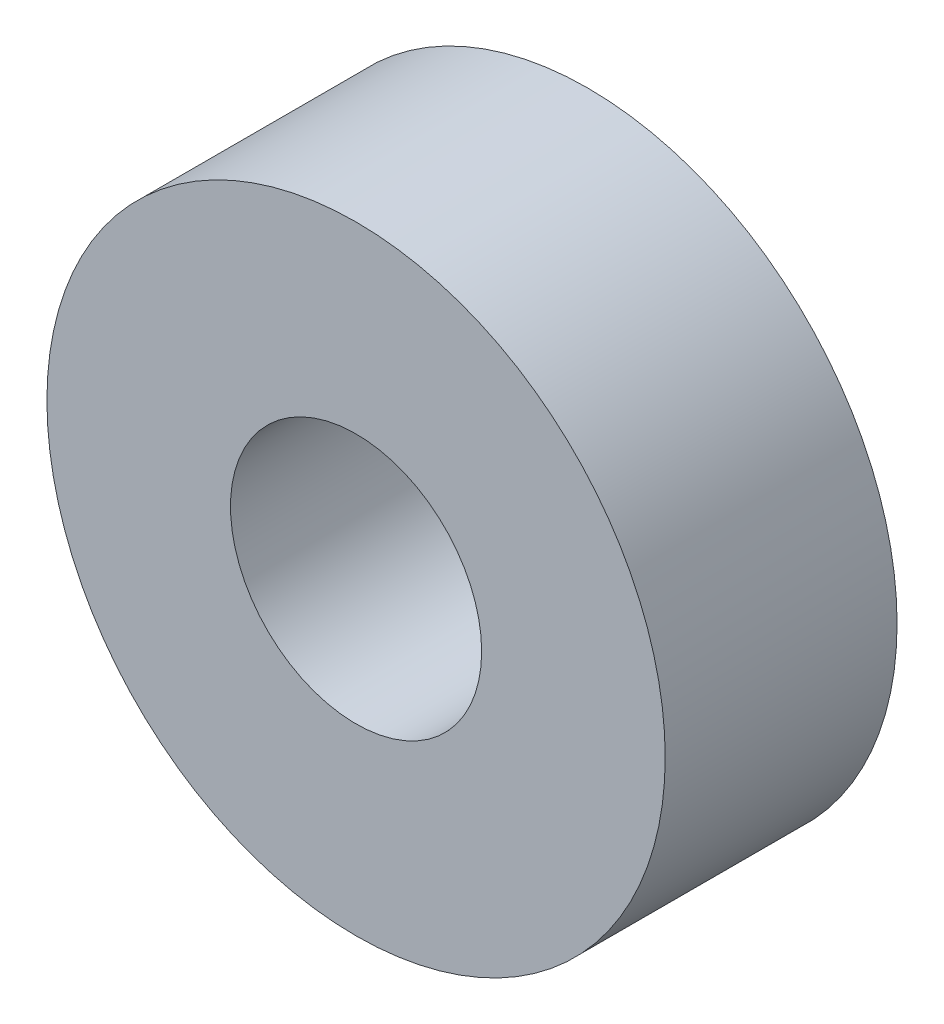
ISO-10303-21;
HEADER;
FILE_DESCRIPTION(('STEP AP214'),'2;1');
FILE_NAME('part.step','',(''),(''),'','','');
FILE_SCHEMA(('AUTOMOTIVE_DESIGN { 1 0 10303 214 1 1 1 1 }'));
ENDSEC;
DATA;
#1=APPLICATION_CONTEXT('core data for automotive mechanical design processes');
#2=APPLICATION_PROTOCOL_DEFINITION('international standard','automotive_design',2000,#1);
#3=PRODUCT_CONTEXT('',#1,'mechanical');
#4=PRODUCT('Part','Part','',(#3));
#5=PRODUCT_RELATED_PRODUCT_CATEGORY('part','',(#4));
#6=PRODUCT_DEFINITION_FORMATION('','',#4);
#7=PRODUCT_DEFINITION_CONTEXT('part definition',#1,'design');
#8=PRODUCT_DEFINITION('design','',#6,#7);
#9=PRODUCT_DEFINITION_SHAPE('','',#8);
#10=(LENGTH_UNIT() NAMED_UNIT(*) SI_UNIT(.MILLI.,.METRE.));
#11=(NAMED_UNIT(*) PLANE_ANGLE_UNIT() SI_UNIT($,.RADIAN.));
#12=(NAMED_UNIT(*) SI_UNIT($,.STERADIAN.) SOLID_ANGLE_UNIT());
#13=UNCERTAINTY_MEASURE_WITH_UNIT(LENGTH_MEASURE(1.E-05),#10,'distance_accuracy_value','');
#14=(GEOMETRIC_REPRESENTATION_CONTEXT(3) GLOBAL_UNCERTAINTY_ASSIGNED_CONTEXT((#13)) GLOBAL_UNIT_ASSIGNED_CONTEXT((#10,
#11,#12)) REPRESENTATION_CONTEXT('',''));
#15=CARTESIAN_POINT('',(0.,0.,0.));
#16=DIRECTION('',(0.,0.,1.));
#17=DIRECTION('',(1.,0.,0.));
#18=AXIS2_PLACEMENT_3D('',#15,#16,#17);
#19=CARTESIAN_POINT('',(0.,0.,3.));
#20=DIRECTION('',(0.,0.,1.));
#21=DIRECTION('',(1.,0.,0.));
#22=AXIS2_PLACEMENT_3D('',#19,#20,#21);
#23=PLANE('',#22);
#24=CARTESIAN_POINT('',(0.,0.,3.));
#25=DIRECTION('',(0.,0.,1.));
#26=DIRECTION('',(1.,0.,0.));
#27=AXIS2_PLACEMENT_3D('',#24,#25,#26);
#28=CIRCLE('',#27,4.);
#29=CARTESIAN_POINT('',(4.,0.,3.));
#30=VERTEX_POINT('',#29);
#31=EDGE_CURVE('E10',#30,#30,#28,.T.);
#32=ORIENTED_EDGE('',*,*,#31,.T.);
#33=EDGE_LOOP('',(#32));
#34=FACE_BOUND('',#33,.T.);
#35=CARTESIAN_POINT('',(0.,0.,3.));
#36=DIRECTION('',(0.,0.,1.));
#37=DIRECTION('',(1.,0.,0.));
#38=AXIS2_PLACEMENT_3D('',#35,#36,#37);
#39=CIRCLE('',#38,1.625);
#40=CARTESIAN_POINT('',(1.625,0.,3.));
#41=VERTEX_POINT('',#40);
#42=EDGE_CURVE('E31',#41,#41,#39,.T.);
#43=ORIENTED_EDGE('',*,*,#42,.F.);
#44=EDGE_LOOP('',(#43));
#45=FACE_BOUND('',#44,.T.);
#46=ADVANCED_FACE('F20',(#34,#45),#23,.T.);
#47=CARTESIAN_POINT('',(0.,0.,0.));
#48=DIRECTION('',(0.,0.,1.));
#49=DIRECTION('',(1.,0.,0.));
#50=AXIS2_PLACEMENT_3D('',#47,#48,#49);
#51=PLANE('',#50);
#52=CARTESIAN_POINT('',(0.,0.,0.));
#53=DIRECTION('',(0.,0.,1.));
#54=DIRECTION('',(1.,0.,0.));
#55=AXIS2_PLACEMENT_3D('',#52,#53,#54);
#56=CIRCLE('',#55,4.);
#57=CARTESIAN_POINT('',(4.,0.,0.));
#58=VERTEX_POINT('',#57);
#59=EDGE_CURVE('E27',#58,#58,#56,.T.);
#60=ORIENTED_EDGE('',*,*,#59,.F.);
#61=EDGE_LOOP('',(#60));
#62=FACE_BOUND('',#61,.T.);
#63=CARTESIAN_POINT('',(0.,0.,0.));
#64=DIRECTION('',(0.,0.,1.));
#65=DIRECTION('',(1.,0.,0.));
#66=AXIS2_PLACEMENT_3D('',#63,#64,#65);
#67=CIRCLE('',#66,1.625);
#68=CARTESIAN_POINT('',(1.625,0.,0.));
#69=VERTEX_POINT('',#68);
#70=EDGE_CURVE('E35',#69,#69,#67,.T.);
#71=ORIENTED_EDGE('',*,*,#70,.T.);
#72=EDGE_LOOP('',(#71));
#73=FACE_BOUND('',#72,.T.);
#74=ADVANCED_FACE('F41',(#62,#73),#51,.F.);
#75=CARTESIAN_POINT('',(0.,0.,3.));
#76=DIRECTION('',(0.,0.,-1.));
#77=DIRECTION('',(-1.,0.,0.));
#78=AXIS2_PLACEMENT_3D('',#75,#76,#77);
#79=CYLINDRICAL_SURFACE('',#78,4.);
#80=ORIENTED_EDGE('',*,*,#31,.F.);
#81=EDGE_LOOP('',(#80));
#82=FACE_BOUND('',#81,.T.);
#83=ORIENTED_EDGE('',*,*,#59,.T.);
#84=EDGE_LOOP('',(#83));
#85=FACE_BOUND('',#84,.T.);
#86=ADVANCED_FACE('F22',(#82,#85),#79,.T.);
#87=CARTESIAN_POINT('',(0.,0.,3.));
#88=DIRECTION('',(0.,0.,-1.));
#89=DIRECTION('',(-1.,0.,0.));
#90=AXIS2_PLACEMENT_3D('',#87,#88,#89);
#91=CYLINDRICAL_SURFACE('',#90,1.625);
#92=ORIENTED_EDGE('',*,*,#42,.T.);
#93=EDGE_LOOP('',(#92));
#94=FACE_BOUND('',#93,.T.);
#95=ORIENTED_EDGE('',*,*,#70,.F.);
#96=EDGE_LOOP('',(#95));
#97=FACE_BOUND('',#96,.T.);
#98=ADVANCED_FACE('F43',(#94,#97),#91,.F.);
#99=CLOSED_SHELL('',(#46,#74,#86,#98));
#100=MANIFOLD_SOLID_BREP('B2',#99);
#101=ADVANCED_BREP_SHAPE_REPRESENTATION('',(#18,#100),#14);
#102=SHAPE_DEFINITION_REPRESENTATION(#9,#101);
ENDSEC;
END-ISO-10303-21;
